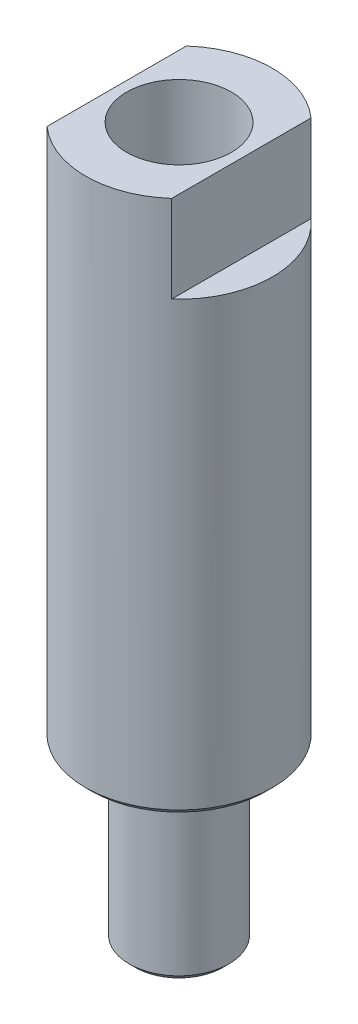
from build123d import *

# Parameters (mm, degrees)
SKETCH1_R          = 7.5
EXTRUDE1_DEPTH     = 43
SKETCH2_R          = 4
EXTRUDE2_DEPTH     = 14
CUT_EXTRUDE1_START = -7
CUT_EXTRUDE1_DEPTH = 7
CHAMFER1_SIZE      = 0.5


with BuildPart() as part:
    # Sketch1 → Extrude1 (new body)
    with BuildSketch(Plane(origin=(0, 0, 0), x_dir=(1, 0, 0), z_dir=(0, 1, 0))):
        with Locations(Location((0, 0, 0), (0, 0, 270))):
            Circle(SKETCH1_R)
    extrude(amount=EXTRUDE1_DEPTH)

    # Sketch2 → Extrude2 (add)
    with BuildSketch(Plane.XZ):
        with Locations(Location((0, 0, 0), (0, 0, 90))):
            Circle(SKETCH2_R)
    extrude(amount=EXTRUDE2_DEPTH)

    # Sketch4 → Cut-Extrude1 (cut)
    with BuildSketch(Plane(origin=(0, 43, 0), x_dir=(-1, 0, 0), z_dir=(0, 1, 0)).offset(CUT_EXTRUDE1_START)):
        with BuildLine():
            Line((-5, -5.590169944), (-5, 5.590169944))
            ThreePointArc((-5, 5.590169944), (-7.5, 0), (-5, -5.590169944))
        make_face()
        with BuildLine():
            ThreePointArc((7.5, 0), (6.846531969, 3.061862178), (5, 5.590169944))
            Line((5, 5.590169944), (5, -5.590169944))
            ThreePointArc((5, -5.590169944), (6.846531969, -3.061862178), (7.5, 0))
        make_face()
    extrude(amount=CUT_EXTRUDE1_DEPTH, mode=Mode.SUBTRACT)

    # Chamfer1
    chamfer1_edges = [part.edges().sort_by_distance(p)[0] for p in [
        (0, 0, -7.5),
        (0, -14, -4),
    ]]
    chamfer(chamfer1_edges, length=CHAMFER1_SIZE)

    # Sketch5 → Cut-Revolve2 (revolve, cut)
    with BuildSketch(Plane.XY, mode=Mode.PRIVATE) as cut_revolve2_sk:
        Polygon((0, 43), (4.2, 43), (4.2, 25), (0, 22.4763854), align=None)
    revolve(cut_revolve2_sk.sketch.rotate(Axis((0, 0, 0), (0, 1, 0)), 131.810314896), axis=Axis((0, 0, 0), (0, 1, 0)), mode=Mode.SUBTRACT)


solid = part.part
